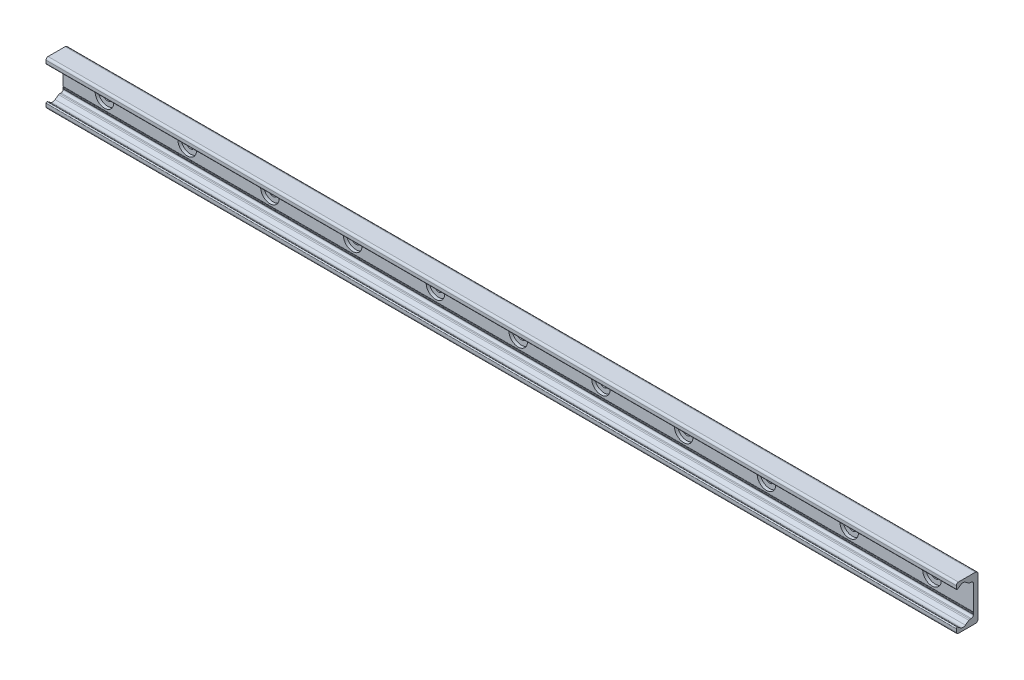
from build123d import *

# Parameters (mm, degrees)
BOSS_EXTRUDE1_DEPTH = 440
SKETCH2_R           = 9
SKETCH2_R_2         = 4.5
CUT_EXTRUDE1_DEPTH  = 3.1
SKETCH2_2_R         = 4.5
CUT_EXTRUDE2_DEPTH  = 441.833868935
LPATTERN1_COUNT     = 11
LPATTERN1_PITCH     = 80


with BuildPart() as part:
    # Sketch1 → Boss-Extrude1 (new, symmetric)
    with BuildSketch(Plane(origin=(0, 0, 0), x_dir=(0, 0, -1), z_dir=(1, 0, 0))):
        with BuildLine():
            Line((0, 0), (0, 19))
            ThreePointArc((0, 19), (-0.732233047, 20.767766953), (-2.5, 21.5))
            Line((-2.5, 21.5), (-19, 21.5))
            ThreePointArc((-19, 21.5), (-20.414213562, 20.914213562), (-21, 19.5))
            Line((-21, 19.5), (-21, 16.625057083))
            ThreePointArc((-21, 16.625057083), (-20.553251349, 15.888838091), (-19.693931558, 15.945160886))
            Line((-19.693931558, 15.945160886), (-16.794305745, 17.975500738))
            ThreePointArc((-16.794305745, 17.975500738), (-14.5, 18.69889256), (-12.205694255, 17.975500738))
            Line((-12.205694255, 17.975500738), (-8.829831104, 15.611695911))
            ThreePointArc((-8.829831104, 15.611695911), (-8.28408983, 15.342566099), (-7.682678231, 15.25))
            Line((-7.682678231, 15.25), (-6.5, 15.25))
            ThreePointArc((-6.5, 15.25), (-5.085786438, 14.664213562), (-4.5, 13.25))
            Line((-4.5, 13.25), (-4.5, -10.75))
            ThreePointArc((-4.5, -10.75), (-4.25, -11), (-4.5, -11.25))
            Line((-4.5, -11.25), (-4.5, -12.25))
            ThreePointArc((-4.5, -12.25), (-4.25, -12.5), (-4.5, -12.75))
            Line((-4.5, -12.75), (-4.5, -13.25))
            ThreePointArc((-4.5, -13.25), (-5.085786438, -14.664213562), (-6.5, -15.25))
            Line((-6.5, -15.25), (-7.682678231, -15.25))
            ThreePointArc((-7.682678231, -15.25), (-8.28408983, -15.342566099), (-8.829831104, -15.611695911))
            Line((-8.829831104, -15.611695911), (-12.205694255, -17.975500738))
            ThreePointArc((-12.205694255, -17.975500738), (-14.5, -18.69889256), (-16.794305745, -17.975500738))
            Line((-16.794305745, -17.975500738), (-19.693931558, -15.945160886))
            ThreePointArc((-19.693931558, -15.945160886), (-20.553251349, -15.888838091), (-21, -16.625057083))
            Line((-21, -16.625057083), (-21, -19.5))
            ThreePointArc((-21, -19.5), (-20.414213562, -20.914213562), (-19, -21.5))
            Line((-19, -21.5), (-2.5, -21.5))
            ThreePointArc((-2.5, -21.5), (-0.732233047, -20.767766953), (0, -19))
            Line((0, -19), (0, 0))
        make_face()
    extrude(amount=BOSS_EXTRUDE1_DEPTH, both=True)

    # Sketch2 → Cut-Extrude1 (cut)
    with BuildSketch(Plane.XY.offset(4.5)):
        with Locations((400, 0)):
            Circle(SKETCH2_R)
        with Locations((400, 0)):
            Circle(SKETCH2_R_2, mode=Mode.SUBTRACT)
    cut_extrude1 = extrude(amount=-CUT_EXTRUDE1_DEPTH, mode=Mode.SUBTRACT)

    # Sketch2_2 → Cut-Extrude2 (cut, through all)
    with BuildSketch(Plane.XY.offset(4.5)):
        with Locations((400, 0)):
            Circle(SKETCH2_2_R)
    cut_extrude2 = extrude(amount=-CUT_EXTRUDE2_DEPTH, mode=Mode.SUBTRACT)

    # LPattern1: Cut-Extrude1, Cut-Extrude2 ×11
    with Locations(*[(-i * LPATTERN1_PITCH, 0, 0) for i in range(1, LPATTERN1_COUNT)]):
        add(cut_extrude1, mode=Mode.SUBTRACT)
        add(cut_extrude2, mode=Mode.SUBTRACT)


solid = part.part
